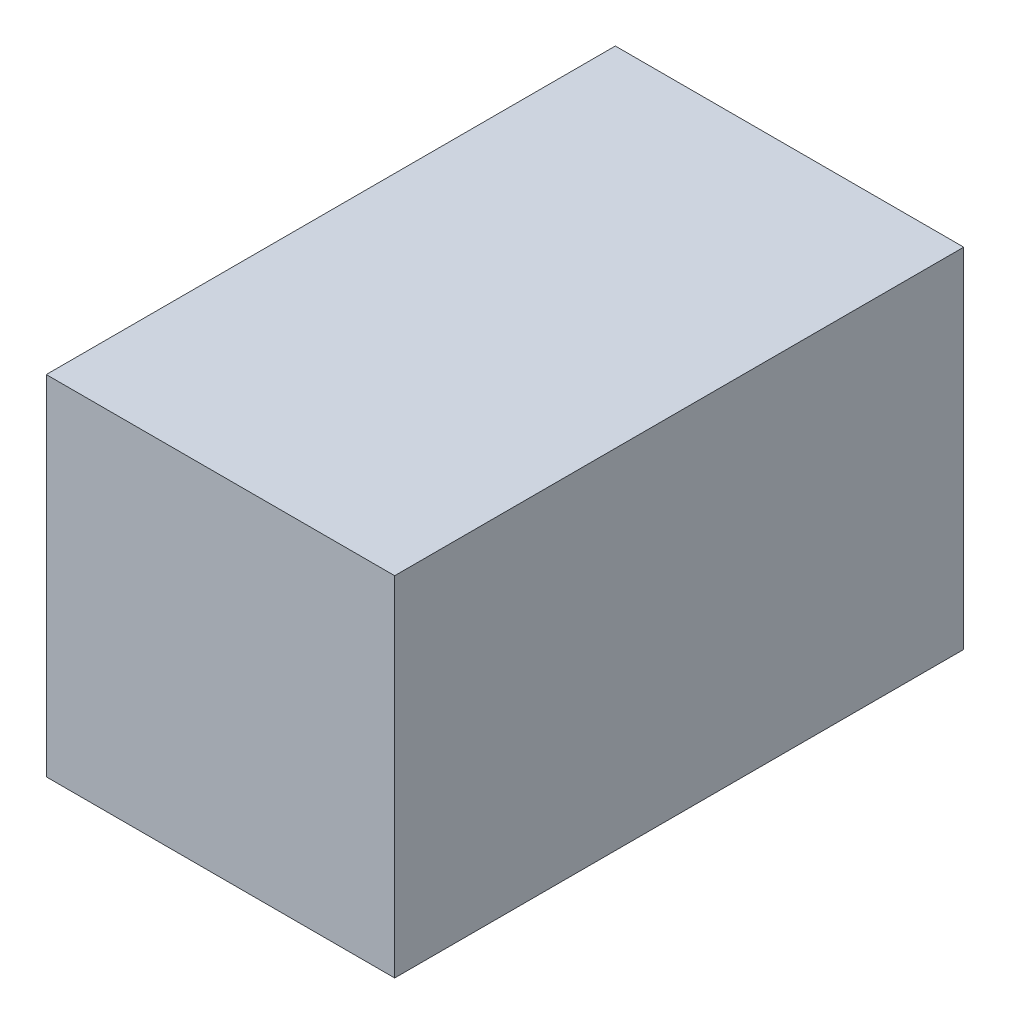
ISO-10303-21;
HEADER;
FILE_DESCRIPTION(('STEP AP214'),'2;1');
FILE_NAME('part.step','',(''),(''),'','','');
FILE_SCHEMA(('AUTOMOTIVE_DESIGN { 1 0 10303 214 1 1 1 1 }'));
ENDSEC;
DATA;
#1=APPLICATION_CONTEXT('core data for automotive mechanical design processes');
#2=APPLICATION_PROTOCOL_DEFINITION('international standard','automotive_design',2000,#1);
#3=PRODUCT_CONTEXT('',#1,'mechanical');
#4=PRODUCT('Part','Part','',(#3));
#5=PRODUCT_RELATED_PRODUCT_CATEGORY('part','',(#4));
#6=PRODUCT_DEFINITION_FORMATION('','',#4);
#7=PRODUCT_DEFINITION_CONTEXT('part definition',#1,'design');
#8=PRODUCT_DEFINITION('design','',#6,#7);
#9=PRODUCT_DEFINITION_SHAPE('','',#8);
#10=(LENGTH_UNIT() NAMED_UNIT(*) SI_UNIT(.MILLI.,.METRE.));
#11=(NAMED_UNIT(*) PLANE_ANGLE_UNIT() SI_UNIT($,.RADIAN.));
#12=(NAMED_UNIT(*) SI_UNIT($,.STERADIAN.) SOLID_ANGLE_UNIT());
#13=UNCERTAINTY_MEASURE_WITH_UNIT(LENGTH_MEASURE(1.E-05),#10,'distance_accuracy_value','');
#14=(GEOMETRIC_REPRESENTATION_CONTEXT(3) GLOBAL_UNCERTAINTY_ASSIGNED_CONTEXT((#13)) GLOBAL_UNIT_ASSIGNED_CONTEXT((#10,
#11,#12)) REPRESENTATION_CONTEXT('',''));
#15=CARTESIAN_POINT('',(0.,0.,0.));
#16=DIRECTION('',(0.,0.,1.));
#17=DIRECTION('',(1.,0.,0.));
#18=AXIS2_PLACEMENT_3D('',#15,#16,#17);
#19=CARTESIAN_POINT('',(0.75000104,-0.7499985,0.));
#20=DIRECTION('',(0.,-1.,0.));
#21=DIRECTION('',(0.,0.,-1.));
#22=AXIS2_PLACEMENT_3D('',#19,#20,#21);
#23=PLANE('',#22);
#24=DIRECTION('',(0.,0.,1.));
#25=VECTOR('',#24,1.);
#26=CARTESIAN_POINT('',(-0.7499985,-0.7499985,0.));
#27=LINE('',#26,#25);
#28=CARTESIAN_POINT('',(-0.7499985,-0.7499985,0.));
#29=VERTEX_POINT('',#28);
#30=CARTESIAN_POINT('',(-0.7499985,-0.7499985,2.45000018));
#31=VERTEX_POINT('',#30);
#32=EDGE_CURVE('E62',#29,#31,#27,.T.);
#33=ORIENTED_EDGE('',*,*,#32,.F.);
#34=DIRECTION('',(1.,0.,0.));
#35=VECTOR('',#34,1.);
#36=CARTESIAN_POINT('',(0.75000104,-0.7499985,0.));
#37=LINE('',#36,#35);
#38=CARTESIAN_POINT('',(0.75000104,-0.7499985,0.));
#39=VERTEX_POINT('',#38);
#40=EDGE_CURVE('E20',#29,#39,#37,.T.);
#41=ORIENTED_EDGE('',*,*,#40,.T.);
#42=DIRECTION('',(0.,0.,-1.));
#43=VECTOR('',#42,1.);
#44=CARTESIAN_POINT('',(0.75000104,-0.7499985,0.));
#45=LINE('',#44,#43);
#46=CARTESIAN_POINT('',(0.75000104,-0.7499985,2.45000018));
#47=VERTEX_POINT('',#46);
#48=EDGE_CURVE('E69',#47,#39,#45,.T.);
#49=ORIENTED_EDGE('',*,*,#48,.F.);
#50=DIRECTION('',(1.,0.,0.));
#51=VECTOR('',#50,1.);
#52=CARTESIAN_POINT('',(-0.7499985,-0.7499985,2.45000018));
#53=LINE('',#52,#51);
#54=EDGE_CURVE('E56',#31,#47,#53,.T.);
#55=ORIENTED_EDGE('',*,*,#54,.F.);
#56=EDGE_LOOP('',(#33,#41,#49,#55));
#57=FACE_BOUND('',#56,.T.);
#58=ADVANCED_FACE('F17',(#57),#23,.T.);
#59=CARTESIAN_POINT('',(-0.7499985,-0.7499985,0.));
#60=DIRECTION('',(-1.,0.,0.));
#61=DIRECTION('',(0.,0.,1.));
#62=AXIS2_PLACEMENT_3D('',#59,#60,#61);
#63=PLANE('',#62);
#64=DIRECTION('',(0.,0.,1.));
#65=VECTOR('',#64,1.);
#66=CARTESIAN_POINT('',(-0.7499985,0.75000104,0.));
#67=LINE('',#66,#65);
#68=CARTESIAN_POINT('',(-0.7499985,0.75000104,0.));
#69=VERTEX_POINT('',#68);
#70=CARTESIAN_POINT('',(-0.7499985,0.75000104,2.45000018));
#71=VERTEX_POINT('',#70);
#72=EDGE_CURVE('E83',#69,#71,#67,.T.);
#73=ORIENTED_EDGE('',*,*,#72,.F.);
#74=DIRECTION('',(0.,1.,0.));
#75=VECTOR('',#74,1.);
#76=CARTESIAN_POINT('',(-0.7499985,0.75000104,0.));
#77=LINE('',#76,#75);
#78=EDGE_CURVE('E67',#69,#29,#77,.F.);
#79=ORIENTED_EDGE('',*,*,#78,.T.);
#80=ORIENTED_EDGE('',*,*,#32,.T.);
#81=DIRECTION('',(0.,1.,0.));
#82=VECTOR('',#81,1.);
#83=CARTESIAN_POINT('',(-0.7499985,0.75000104,2.45000018));
#84=LINE('',#83,#82);
#85=EDGE_CURVE('E64',#71,#31,#84,.F.);
#86=ORIENTED_EDGE('',*,*,#85,.F.);
#87=EDGE_LOOP('',(#73,#79,#80,#86));
#88=FACE_BOUND('',#87,.T.);
#89=ADVANCED_FACE('F63',(#88),#63,.T.);
#90=CARTESIAN_POINT('',(-0.7499985,0.75000104,2.45000018));
#91=DIRECTION('',(0.,0.,1.));
#92=DIRECTION('',(1.,0.,0.));
#93=AXIS2_PLACEMENT_3D('',#90,#91,#92);
#94=PLANE('',#93);
#95=DIRECTION('',(0.,1.,0.));
#96=VECTOR('',#95,1.);
#97=CARTESIAN_POINT('',(0.75000104,0.75000104,2.45000018));
#98=LINE('',#97,#96);
#99=CARTESIAN_POINT('',(0.75000104,0.75000104,2.45000018));
#100=VERTEX_POINT('',#99);
#101=EDGE_CURVE('E71',#100,#47,#98,.F.);
#102=ORIENTED_EDGE('',*,*,#101,.F.);
#103=DIRECTION('',(1.,0.,0.));
#104=VECTOR('',#103,1.);
#105=CARTESIAN_POINT('',(-0.7499985,0.75000104,2.45000018));
#106=LINE('',#105,#104);
#107=EDGE_CURVE('E75',#71,#100,#106,.T.);
#108=ORIENTED_EDGE('',*,*,#107,.F.);
#109=ORIENTED_EDGE('',*,*,#85,.T.);
#110=ORIENTED_EDGE('',*,*,#54,.T.);
#111=EDGE_LOOP('',(#102,#108,#109,#110));
#112=FACE_BOUND('',#111,.T.);
#113=ADVANCED_FACE('F73',(#112),#94,.T.);
#114=CARTESIAN_POINT('',(0.75000104,0.75000104,0.));
#115=DIRECTION('',(1.,0.,0.));
#116=DIRECTION('',(0.,0.,-1.));
#117=AXIS2_PLACEMENT_3D('',#114,#115,#116);
#118=PLANE('',#117);
#119=ORIENTED_EDGE('',*,*,#48,.T.);
#120=DIRECTION('',(0.,1.,0.));
#121=VECTOR('',#120,1.);
#122=CARTESIAN_POINT('',(0.75000104,0.75000104,0.));
#123=LINE('',#122,#121);
#124=CARTESIAN_POINT('',(0.75000104,0.75000104,0.));
#125=VERTEX_POINT('',#124);
#126=EDGE_CURVE('E35',#39,#125,#123,.T.);
#127=ORIENTED_EDGE('',*,*,#126,.T.);
#128=DIRECTION('',(0.,0.,1.));
#129=VECTOR('',#128,1.);
#130=CARTESIAN_POINT('',(0.75000104,0.75000104,0.));
#131=LINE('',#130,#129);
#132=EDGE_CURVE('E26',#100,#125,#131,.F.);
#133=ORIENTED_EDGE('',*,*,#132,.F.);
#134=ORIENTED_EDGE('',*,*,#101,.T.);
#135=EDGE_LOOP('',(#119,#127,#133,#134));
#136=FACE_BOUND('',#135,.T.);
#137=ADVANCED_FACE('F89',(#136),#118,.T.);
#138=CARTESIAN_POINT('',(-0.7499985,0.75000104,0.));
#139=DIRECTION('',(0.,0.,1.));
#140=DIRECTION('',(1.,0.,0.));
#141=AXIS2_PLACEMENT_3D('',#138,#139,#140);
#142=PLANE('',#141);
#143=ORIENTED_EDGE('',*,*,#126,.F.);
#144=ORIENTED_EDGE('',*,*,#40,.F.);
#145=ORIENTED_EDGE('',*,*,#78,.F.);
#146=DIRECTION('',(1.,0.,0.));
#147=VECTOR('',#146,1.);
#148=CARTESIAN_POINT('',(-0.7499985,0.75000104,0.));
#149=LINE('',#148,#147);
#150=EDGE_CURVE('E11',#125,#69,#149,.F.);
#151=ORIENTED_EDGE('',*,*,#150,.F.);
#152=EDGE_LOOP('',(#143,#144,#145,#151));
#153=FACE_BOUND('',#152,.T.);
#154=ADVANCED_FACE('F91',(#153),#142,.F.);
#155=CARTESIAN_POINT('',(-0.7499985,0.75000104,0.));
#156=DIRECTION('',(0.,1.,0.));
#157=DIRECTION('',(0.,0.,1.));
#158=AXIS2_PLACEMENT_3D('',#155,#156,#157);
#159=PLANE('',#158);
#160=ORIENTED_EDGE('',*,*,#132,.T.);
#161=ORIENTED_EDGE('',*,*,#150,.T.);
#162=ORIENTED_EDGE('',*,*,#72,.T.);
#163=ORIENTED_EDGE('',*,*,#107,.T.);
#164=EDGE_LOOP('',(#160,#161,#162,#163));
#165=FACE_BOUND('',#164,.T.);
#166=ADVANCED_FACE('F88',(#165),#159,.T.);
#167=CLOSED_SHELL('',(#58,#89,#113,#137,#154,#166));
#168=MANIFOLD_SOLID_BREP('B1',#167);
#169=ADVANCED_BREP_SHAPE_REPRESENTATION('',(#18,#168),#14);
#170=SHAPE_DEFINITION_REPRESENTATION(#9,#169);
ENDSEC;
END-ISO-10303-21;
